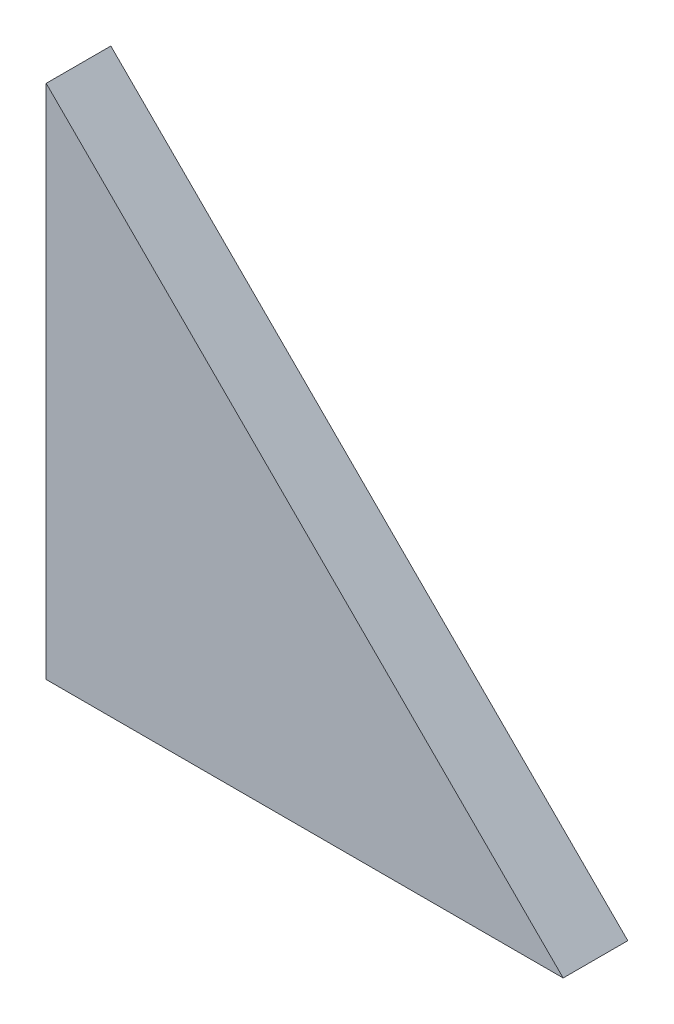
from build123d import *

# Parameters (mm, degrees)
EXTRUDE1_DEPTH = 12.7


with BuildPart() as part:
    # Sketch1 → Extrude1 (new body)
    with BuildSketch(Plane.XY):
        Polygon((0, 0), (0, 101.476236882), (101.6, 0), align=None)
    extrude(amount=EXTRUDE1_DEPTH)


solid = part.part
